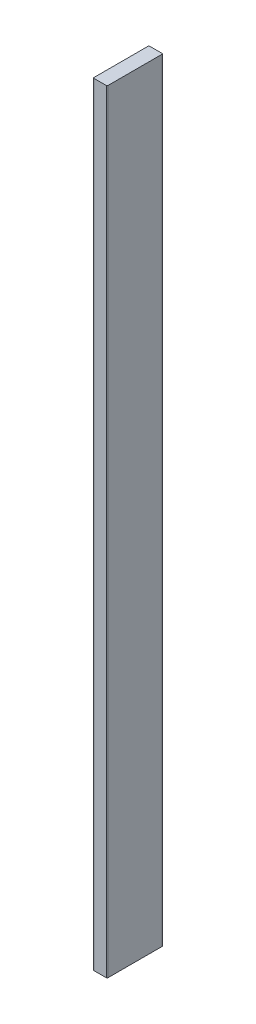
from build123d import *

# Parameters (mm, degrees)
BOSS_EXTRU_1_DEPTH = 555


with BuildPart() as part:
    # Esquisse1 → Boss.-Extru.1 (new body)
    with BuildSketch(Plane(origin=(0, 277.5, 0), x_dir=(1, 0, 0), z_dir=(0, 1, 0))):
        with BuildLine():
            Line((-4.5, -20), (4.5, -20))
            ThreePointArc((4.5, -20), (4.853553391, -19.853553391), (5, -19.5))
            Line((5, -19.5), (5, 19.5))
            ThreePointArc((5, 19.5), (4.853553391, 19.853553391), (4.5, 20))
            Line((4.5, 20), (-4.5, 20))
            ThreePointArc((-4.5, 20), (-4.853553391, 19.853553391), (-5, 19.5))
            Line((-5, 19.5), (-5, -19.5))
            ThreePointArc((-5, -19.5), (-4.853553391, -19.853553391), (-4.5, -20))
        make_face()
    extrude(amount=-BOSS_EXTRU_1_DEPTH)


solid = part.part
